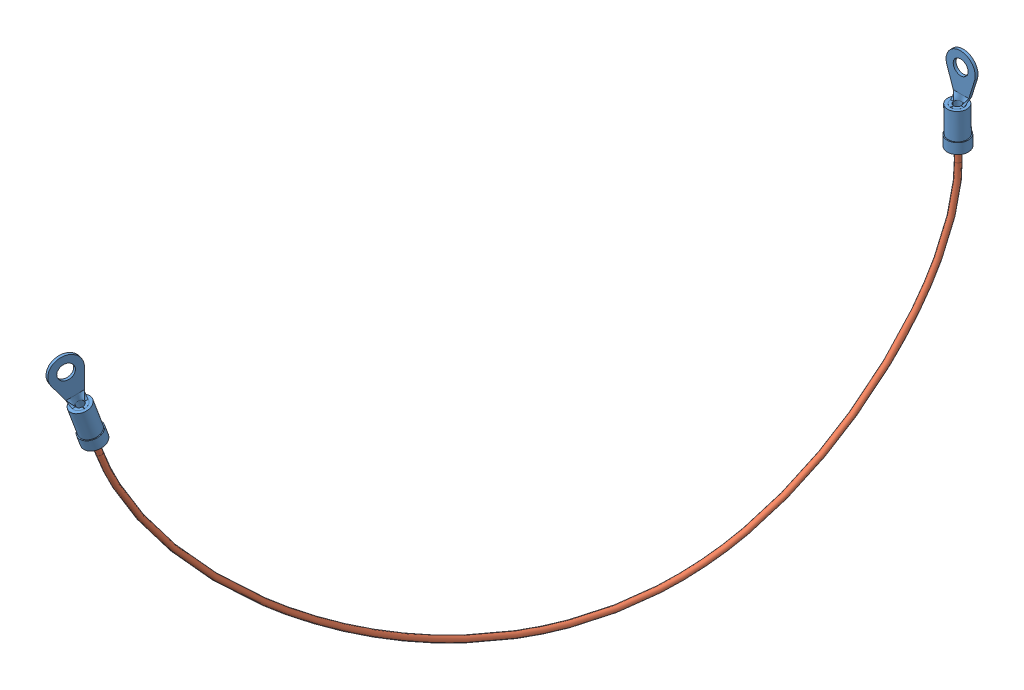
SolidWorks assembly Ring_1-0_10.sldasm, configuration Default (file format 13000). Lengths in mm.
Overall size (53.66 119.66 219.48).
3 component instances, 2 part files, 4 mates.
Components (placement in the parent):
- ring_term_awg-14_10-15: ring_term_awg-14_10.SLDPRT [Default] at (-13.4964 143.5611 297.0667) x (0.095492 -0.951057 -0.293893) z (-0.293893 -0.309017 0.904508) size (27.02 6.1 8.38)
- ring_term_awg-14_10-16: ring_term_awg-14_10.SLDPRT [Default] at (32.5019 136.9038 86.227) x (0 -0.999848 -0.017452) z (-1 0 0) size (27.02 6.1 8.38)
- Cable_1-Ring_1-0_10-1: Cable_1-Ring_1-0_10.sldprt [Default] at origin size (45.47 97.11 208.44)
Mates (geometry in assembly coordinates):
- Concentric11: concentric: cylinder of assembly through (-15.4591 143.5611 296.429) axis (0.951057 0 0.309017) radius 1.905; cylinder of ring_term_awg-14_10-15 through (-14.2513 143.5611 296.8214) axis (0.951057 0 0.309017) radius 2.1463; cylinder of ?
- Coincident11: coincident anti-aligned: plane of ring_term_awg-14_10-15 through (-14.2513 143.5611 296.8214) normal (-0.951057 0 -0.309017); plane of assembly through (-14.2513 115.2525 296.8214) normal (0.951057 0 0.309017)
- Concentric21: concentric: cylinder of assembly through (32.5019 136.962 82.8937) axis (0 -0.017452 0.999848) radius 1.5875; cylinder of ring_term_awg-14_10-16 through (32.5019 136.9177 85.4333) axis (0 -0.017452 0.999848) radius 2.1463; cylinder of ?
- Coincident21: coincident anti-aligned: plane of ring_term_awg-14_10-16 through (32.5019 136.9177 85.4333) normal (0 0.017452 -0.999848); plane of assembly through (85.8 157.9245 85.8) normal (0 -0.017452 0.999848)
